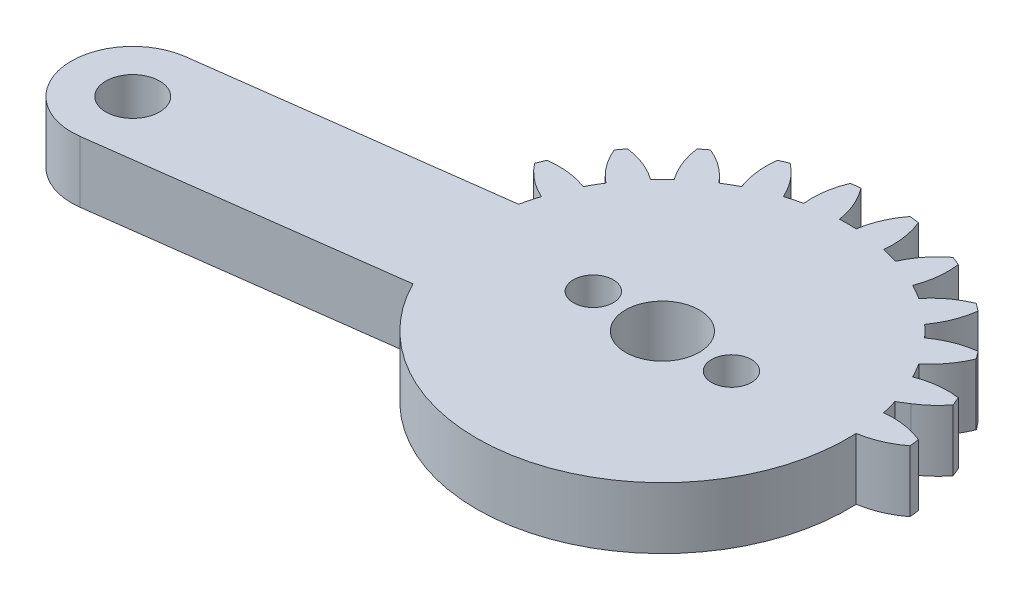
from build123d import *
from build123d.topology import SkipClean

# Parameters (mm, degrees)
SKETCH1_R           = 1.5
BOSS_EXTRUDE1_DEPTH = 4
SKETCH3_R           = 1.75
BOSS_EXTRUDE2_DEPTH = 4
CUT_EXTRUDE1_START  = -4
CUT_EXTRUDE1_DEPTH  = 4
CUT_EXTRUDE2_REACH  = 49.073
SKETCH5_R           = 1.3
SKETCH5_R_2         = 2.4


with BuildPart() as part:
    # Sketch1 → Boss-Extrude1 (new body)
    with BuildSketch(Plane(origin=(0, 0, 0), x_dir=(1, 0, 0), z_dir=(0, 1, 0))):
        with BuildLine():
            Line((20.643657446, 4), (2.081641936, 4))
            ThreePointArc((2.081641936, 4), (2.861028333, 4.588201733), (3.521749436, 5.30713988))
            ThreePointArc((3.521749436, 5.30713988), (3.405395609, 5.596745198), (3.282888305, 5.883801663))
            ThreePointArc((3.282888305, 5.883801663), (1.93527598, 5.894040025), (0.627094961, 5.57027124))
            ThreePointArc((0.627094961, 5.57027124), (0.366286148, 6.046375), (0.084372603, 6.510293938))
            ThreePointArc((0.084372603, 6.510293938), (1.018855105, 7.48132754), (1.683794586, 8.65351323))
            ThreePointArc((1.683794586, 8.65351323), (1.496450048, 8.903135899), (1.303821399, 9.148703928))
            ThreePointArc((1.303821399, 9.148703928), (-0.000522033, 8.809805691), (-1.180330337, 8.158486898))
            ThreePointArc((-1.180330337, 8.158486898), (-1.555477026, 8.550865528), (-1.947855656, 8.926012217))
            ThreePointArc((-1.947855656, 8.926012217), (-1.296536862, 10.105820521), (-0.957638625, 11.410163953))
            ThreePointArc((-0.957638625, 11.410163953), (-1.203206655, 11.602792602), (-1.452829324, 11.79013714))
            ThreePointArc((-1.452829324, 11.79013714), (-2.625015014, 11.125197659), (-3.596048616, 10.190715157))
            ThreePointArc((-3.596048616, 10.190715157), (-4.059967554, 10.472628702), (-4.536071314, 10.733437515))
            ThreePointArc((-4.536071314, 10.733437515), (-4.212302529, 12.041618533), (-4.222540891, 13.389230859))
            ThreePointArc((-4.222540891, 13.389230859), (-4.509597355, 13.511738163), (-4.799202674, 13.62809199))
            ThreePointArc((-4.799202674, 13.62809199), (-5.759348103, 12.682425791), (-6.455432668, 11.528463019))
            ThreePointArc((-6.455432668, 11.528463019), (-6.976508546, 11.680699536), (-7.503891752, 11.809396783))
            ThreePointArc((-7.503891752, 11.809396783), (-7.529737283, 13.156800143), (-7.888414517, 14.455843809))
            ThreePointArc((-7.888414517, 14.455843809), (-8.197396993, 14.499881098), (-8.507248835, 14.537314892))
            ThreePointArc((-8.507248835, 14.537314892), (-9.18992168, 13.375367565), (-9.563620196, 12.080565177))
            ThreePointArc((-9.563620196, 12.080565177), (-10.106342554, 12.09275), (-10.649064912, 12.080565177))
            ThreePointArc((-10.649064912, 12.080565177), (-11.022763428, 13.375367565), (-11.705436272, 14.537314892))
            ThreePointArc((-11.705436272, 14.537314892), (-12.015288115, 14.499881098), (-12.324270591, 14.455843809))
            ThreePointArc((-12.324270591, 14.455843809), (-12.682947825, 13.156800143), (-12.708793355, 11.809396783))
            ThreePointArc((-12.708793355, 11.809396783), (-13.236176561, 11.680699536), (-13.757252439, 11.528463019))
            ThreePointArc((-13.757252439, 11.528463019), (-14.453337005, 12.682425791), (-15.413482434, 13.62809199))
            ThreePointArc((-15.413482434, 13.62809199), (-15.703087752, 13.511738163), (-15.990144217, 13.389230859))
            ThreePointArc((-15.990144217, 13.389230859), (-16.000382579, 12.041618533), (-15.676613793, 10.733437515))
            ThreePointArc((-15.676613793, 10.733437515), (-16.152717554, 10.472628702), (-16.616636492, 10.190715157))
            ThreePointArc((-16.616636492, 10.190715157), (-17.587670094, 11.125197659), (-18.759855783, 11.79013714))
            ThreePointArc((-18.759855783, 11.79013714), (-19.009478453, 11.602792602), (-19.255046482, 11.410163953))
            ThreePointArc((-19.255046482, 11.410163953), (-18.916148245, 10.105820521), (-18.264829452, 8.926012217))
            ThreePointArc((-18.264829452, 8.926012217), (-18.657208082, 8.550865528), (-19.032354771, 8.158486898))
            ThreePointArc((-19.032354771, 8.158486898), (-20.212163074, 8.809805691), (-21.516506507, 9.148703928))
            ThreePointArc((-21.516506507, 9.148703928), (-21.709135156, 8.903135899), (-21.896479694, 8.65351323))
            ThreePointArc((-21.896479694, 8.65351323), (-21.231540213, 7.48132754), (-20.297057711, 6.510293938))
            ThreePointArc((-20.297057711, 6.510293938), (-20.578971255, 6.046375), (-20.839780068, 5.57027124))
            ThreePointArc((-20.839780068, 5.57027124), (-22.147961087, 5.894040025), (-23.495573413, 5.883801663))
            ThreePointArc((-23.495573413, 5.883801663), (-23.618080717, 5.596745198), (-23.734434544, 5.30713988))
            ThreePointArc((-23.734434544, 5.30713988), (-22.788768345, 4.346994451), (-21.634805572, 3.650909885))
            ThreePointArc((-21.634805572, 3.650909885), (-21.78704209, 3.129834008), (-21.915739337, 2.602450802))
            ThreePointArc((-21.915739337, 2.602450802), (-23.263142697, 2.576605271), (-24.562186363, 2.217928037))
            ThreePointArc((-24.562186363, 2.217928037), (-24.606223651, 1.908945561), (-24.643657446, 1.599093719))
            ThreePointArc((-24.643657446, 1.599093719), (-23.481710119, 0.916420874), (-22.186907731, 0.542722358))
            ThreePointArc((-22.186907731, 0.542722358), (-22.199092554, 0), (-22.186907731, -0.542722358))
            ThreePointArc((-22.186907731, -0.542722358), (-23.481710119, -0.916420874), (-24.643657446, -1.599093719))
            ThreePointArc((-24.643657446, -1.599093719), (-24.606223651, -1.908945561), (-24.562186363, -2.217928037))
            ThreePointArc((-24.562186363, -2.217928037), (-23.263142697, -2.576605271), (-21.915739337, -2.602450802))
            ThreePointArc((-21.915739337, -2.602450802), (-21.78704209, -3.129834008), (-21.634805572, -3.650909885))
            ThreePointArc((-21.634805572, -3.650909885), (-22.788768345, -4.346994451), (-23.734434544, -5.30713988))
            ThreePointArc((-23.734434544, -5.30713988), (-23.618080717, -5.596745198), (-23.495573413, -5.883801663))
            ThreePointArc((-23.495573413, -5.883801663), (-22.147961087, -5.894040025), (-20.839780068, -5.57027124))
            ThreePointArc((-20.839780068, -5.57027124), (-20.578971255, -6.046375), (-20.297057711, -6.510293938))
            ThreePointArc((-20.297057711, -6.510293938), (-21.231540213, -7.48132754), (-21.896479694, -8.65351323))
            ThreePointArc((-21.896479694, -8.65351323), (-21.709135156, -8.903135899), (-21.516506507, -9.148703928))
            ThreePointArc((-21.516506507, -9.148703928), (-20.212163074, -8.809805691), (-19.032354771, -8.158486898))
            ThreePointArc((-19.032354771, -8.158486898), (-18.657208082, -8.550865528), (-18.264829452, -8.926012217))
            ThreePointArc((-18.264829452, -8.926012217), (-18.916148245, -10.105820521), (-19.255046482, -11.410163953))
            ThreePointArc((-19.255046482, -11.410163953), (-19.009478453, -11.602792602), (-18.759855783, -11.79013714))
            ThreePointArc((-18.759855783, -11.79013714), (-17.587670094, -11.125197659), (-16.616636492, -10.190715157))
            ThreePointArc((-16.616636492, -10.190715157), (-16.152717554, -10.472628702), (-15.676613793, -10.733437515))
            ThreePointArc((-15.676613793, -10.733437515), (-16.000382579, -12.041618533), (-15.990144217, -13.389230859))
            ThreePointArc((-15.990144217, -13.389230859), (-15.703087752, -13.511738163), (-15.413482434, -13.62809199))
            ThreePointArc((-15.413482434, -13.62809199), (-14.453337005, -12.682425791), (-13.757252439, -11.528463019))
            ThreePointArc((-13.757252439, -11.528463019), (-13.236176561, -11.680699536), (-12.708793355, -11.809396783))
            ThreePointArc((-12.708793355, -11.809396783), (-12.682947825, -13.156800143), (-12.324270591, -14.455843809))
            ThreePointArc((-12.324270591, -14.455843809), (-12.015288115, -14.499881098), (-11.705436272, -14.537314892))
            ThreePointArc((-11.705436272, -14.537314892), (-11.022763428, -13.375367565), (-10.649064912, -12.080565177))
            ThreePointArc((-10.649064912, -12.080565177), (-10.106342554, -12.09275), (-9.563620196, -12.080565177))
            ThreePointArc((-9.563620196, -12.080565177), (-9.18992168, -13.375367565), (-8.507248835, -14.537314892))
            ThreePointArc((-8.507248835, -14.537314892), (-8.197396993, -14.499881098), (-7.888414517, -14.455843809))
            ThreePointArc((-7.888414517, -14.455843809), (-7.529737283, -13.156800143), (-7.503891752, -11.809396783))
            ThreePointArc((-7.503891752, -11.809396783), (-6.976508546, -11.680699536), (-6.455432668, -11.528463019))
            ThreePointArc((-6.455432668, -11.528463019), (-5.759348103, -12.682425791), (-4.799202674, -13.62809199))
            ThreePointArc((-4.799202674, -13.62809199), (-4.509597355, -13.511738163), (-4.222540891, -13.389230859))
            ThreePointArc((-4.222540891, -13.389230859), (-4.212302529, -12.041618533), (-4.536071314, -10.733437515))
            ThreePointArc((-4.536071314, -10.733437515), (-4.059967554, -10.472628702), (-3.596048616, -10.190715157))
            ThreePointArc((-3.596048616, -10.190715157), (-2.625015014, -11.125197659), (-1.452829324, -11.79013714))
            ThreePointArc((-1.452829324, -11.79013714), (-1.203206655, -11.602792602), (-0.957638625, -11.410163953))
            ThreePointArc((-0.957638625, -11.410163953), (-1.296536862, -10.105820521), (-1.947855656, -8.926012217))
            ThreePointArc((-1.947855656, -8.926012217), (-1.555477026, -8.550865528), (-1.180330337, -8.158486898))
            ThreePointArc((-1.180330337, -8.158486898), (-0.000522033, -8.809805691), (1.303821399, -9.148703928))
            ThreePointArc((1.303821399, -9.148703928), (1.496450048, -8.903135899), (1.683794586, -8.65351323))
            ThreePointArc((1.683794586, -8.65351323), (1.018855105, -7.48132754), (0.084372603, -6.510293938))
            ThreePointArc((0.084372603, -6.510293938), (0.366286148, -6.046375), (0.627094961, -5.57027124))
            ThreePointArc((0.627094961, -5.57027124), (1.93527598, -5.894040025), (3.282888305, -5.883801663))
            ThreePointArc((3.282888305, -5.883801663), (3.405395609, -5.596745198), (3.521749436, -5.30713988))
            ThreePointArc((3.521749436, -5.30713988), (2.861028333, -4.588201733), (2.081641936, -4))
            Line((2.081641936, -4), (20.643657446, -4))
            ThreePointArc((20.643657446, -4), (24.643657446, 0), (20.643657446, 4))
        make_face()
        with Locations(Location((-10.106342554, 0, 0), (0, 0, 270))):
            Circle(SKETCH1_R, mode=Mode.SUBTRACT)
        with Locations(Location((20.643657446, 0, 0), (0, 0, 270))):
            Circle(SKETCH1_R, mode=Mode.SUBTRACT)
    extrude(amount=BOSS_EXTRUDE1_DEPTH)

    # Sketch3 → Boss-Extrude2 (add)
    with BuildSketch(Plane(origin=(0, 4, 0), x_dir=(1, 0, 0), z_dir=(0, 1, 0))):
        with BuildLine():
            ThreePointArc((-9.584237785, -3.965779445), (-14.072121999, -0.522104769), (-10.628447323, 3.965779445))
            Line((-10.628447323, 3.965779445), (-41.11537681, -0.047900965))
            ThreePointArc((-41.11537681, -0.047900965), (-44.559051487, -4.53578518), (-40.071167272, -7.979459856))
            Line((-40.071167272, -7.979459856), (-9.584237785, -3.965779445))
        make_face()
        with Locations(Location((-40.593272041, -4.013680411, 0), (0, 0, 270))):
            Circle(SKETCH3_R, mode=Mode.SUBTRACT)
    extrude(amount=-BOSS_EXTRUDE2_DEPTH)

    # Sketch4 → Cut-Extrude1 (cut)
    with SkipClean():  # the faces are left unmerged after this step: merging them gives an invalid solid
        with BuildSketch(Plane(origin=(0, 4, 0), x_dir=(1, 0, 0), z_dir=(0, 1, 0)).offset(CUT_EXTRUDE1_START)):
            with BuildLine():
                ThreePointArc((20.643657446, -4), (24.643657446, 0), (20.643657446, 4))
                Line((20.643657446, 4), (2.081641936, 4))
                Line((2.081641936, 4), (1.43808022, 3.600125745))
                ThreePointArc((1.43808022, 3.600125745), (1.581217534, 3.104116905), (1.70305423, 2.602450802))
                ThreePointArc((1.70305423, 2.602450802), (3.050457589, 2.576605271), (4.349501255, 2.217928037))
                ThreePointArc((4.349501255, 2.217928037), (4.393538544, 1.908945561), (4.430972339, 1.599093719))
                ThreePointArc((4.430972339, 1.599093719), (3.269025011, 0.916420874), (1.974222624, 0.542722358))
                ThreePointArc((1.974222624, 0.542722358), (1.70305423, -2.602450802), (0.627094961, -5.57027124))
                ThreePointArc((0.627094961, -5.57027124), (1.93527598, -5.894040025), (3.282888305, -5.883801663))
                ThreePointArc((3.282888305, -5.883801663), (3.405395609, -5.596745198), (3.521749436, -5.30713988))
                ThreePointArc((3.521749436, -5.30713988), (2.861028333, -4.588201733), (2.081641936, -4))
                Line((2.081641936, -4), (20.643657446, -4))
            make_face()
            with BuildLine():
                ThreePointArc((1.683794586, -8.65351323), (1.018855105, -7.48132754), (0.084372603, -6.510293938))
                ThreePointArc((0.084372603, -6.510293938), (-0.512518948, -7.361599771), (-1.180330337, -8.158486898))
                ThreePointArc((-1.180330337, -8.158486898), (-0.000522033, -8.809805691), (1.303821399, -9.148703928))
                ThreePointArc((1.303821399, -9.148703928), (1.496450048, -8.903135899), (1.683794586, -8.65351323))
            make_face()
            with BuildLine():
                ThreePointArc((-0.957638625, -11.410163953), (-1.296536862, -10.105820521), (-1.947855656, -8.926012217))
                ThreePointArc((-1.947855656, -8.926012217), (-2.744742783, -9.593823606), (-3.596048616, -10.190715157))
                ThreePointArc((-3.596048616, -10.190715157), (-2.625015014, -11.125197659), (-1.452829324, -11.79013714))
                ThreePointArc((-1.452829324, -11.79013714), (-1.203206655, -11.602792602), (-0.957638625, -11.410163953))
            make_face()
            with BuildLine():
                ThreePointArc((-4.222540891, -13.389230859), (-4.212302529, -12.041618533), (-4.536071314, -10.733437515))
                ThreePointArc((-4.536071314, -10.733437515), (-5.478647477, -11.172244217), (-6.455432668, -11.528463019))
                ThreePointArc((-6.455432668, -11.528463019), (-5.759348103, -12.682425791), (-4.799202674, -13.62809199))
                ThreePointArc((-4.799202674, -13.62809199), (-4.509597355, -13.511738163), (-4.222540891, -13.389230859))
            make_face()
            with BuildLine():
                ThreePointArc((-7.888414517, -14.455843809), (-7.529737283, -13.156800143), (-7.503891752, -11.809396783))
                ThreePointArc((-7.503891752, -11.809396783), (-8.527921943, -11.989294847), (-9.563620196, -12.080565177))
                ThreePointArc((-9.563620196, -12.080565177), (-9.18992168, -13.375367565), (-8.507248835, -14.537314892))
                ThreePointArc((-8.507248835, -14.537314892), (-8.197396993, -14.499881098), (-7.888414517, -14.455843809))
            make_face()
            with BuildLine():
                ThreePointArc((-11.705436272, -14.537314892), (-11.022763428, -13.375367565), (-10.649064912, -12.080565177))
                ThreePointArc((-10.649064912, -12.080565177), (-11.684763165, -11.989294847), (-12.708793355, -11.809396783))
                ThreePointArc((-12.708793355, -11.809396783), (-12.682947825, -13.156800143), (-12.324270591, -14.455843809))
                ThreePointArc((-12.324270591, -14.455843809), (-12.015288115, -14.499881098), (-11.705436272, -14.537314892))
            make_face()
            with BuildLine():
                ThreePointArc((-15.413482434, -13.62809199), (-14.453337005, -12.682425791), (-13.757252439, -11.528463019))
                ThreePointArc((-13.757252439, -11.528463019), (-14.734037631, -11.172244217), (-15.676613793, -10.733437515))
                ThreePointArc((-15.676613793, -10.733437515), (-16.000382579, -12.041618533), (-15.990144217, -13.389230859))
                ThreePointArc((-15.990144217, -13.389230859), (-15.703087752, -13.511738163), (-15.413482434, -13.62809199))
            make_face()
            with BuildLine():
                ThreePointArc((-18.759855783, -11.79013714), (-17.587670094, -11.125197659), (-16.616636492, -10.190715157))
                ThreePointArc((-16.616636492, -10.190715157), (-17.467942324, -9.593823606), (-18.264829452, -8.926012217))
                ThreePointArc((-18.264829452, -8.926012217), (-18.916148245, -10.105820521), (-19.255046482, -11.410163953))
                ThreePointArc((-19.255046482, -11.410163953), (-19.009478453, -11.602792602), (-18.759855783, -11.79013714))
            make_face()
            with BuildLine():
                ThreePointArc((-21.516506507, -9.148703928), (-20.212163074, -8.809805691), (-19.032354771, -8.158486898))
                ThreePointArc((-19.032354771, -8.158486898), (-19.70016616, -7.361599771), (-20.297057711, -6.510293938))
                ThreePointArc((-20.297057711, -6.510293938), (-21.231540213, -7.48132754), (-21.896479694, -8.65351323))
                ThreePointArc((-21.896479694, -8.65351323), (-21.709135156, -8.903135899), (-21.516506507, -9.148703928))
            make_face()
            with BuildLine():
                ThreePointArc((-21.942853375, 2.47620963), (-21.92946485, 2.539366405), (-21.915739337, 2.602450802))
                ThreePointArc((-21.915739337, 2.602450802), (-23.263142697, 2.576605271), (-24.562186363, 2.217928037))
                ThreePointArc((-24.562186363, 2.217928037), (-24.56889027, 2.173784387), (-24.575459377, 2.129620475))
                Line((-24.575459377, 2.129620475), (-21.942853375, 2.47620963))
            make_face()
            with BuildLine():
                ThreePointArc((-23.495573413, -5.883801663), (-22.147961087, -5.894040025), (-20.839780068, -5.57027124))
                ThreePointArc((-20.839780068, -5.57027124), (-20.869365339, -5.512888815), (-20.898643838, -5.455349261))
                Line((-20.898643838, -5.455349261), (-23.531249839, -5.801938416))
                ThreePointArc((-23.531249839, -5.801938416), (-23.513474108, -5.842897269), (-23.495573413, -5.883801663))
            make_face()
        extrude(amount=CUT_EXTRUDE1_DEPTH, mode=Mode.SUBTRACT)

    # Sketch5 → Cut-Extrude2 (cut, up to next)
    with BuildSketch(Plane(origin=(0, 4, 0), x_dir=(1, 0, 0), z_dir=(0, 1, 0)), mode=Mode.PRIVATE) as cut_extrude2_sk1:
        with Locations(Location((-14.606342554, 0, 0), (0, 0, 270))):
            Circle(SKETCH5_R)
    cut_extrude2_tool1 = extrude(cut_extrude2_sk1.sketch, amount=-CUT_EXTRUDE2_REACH, mode=Mode.PRIVATE) & part.part
    # Sketch5 → Cut-Extrude2 (cut, up to next)
    with BuildSketch(Plane(origin=(0, 4, 0), x_dir=(1, 0, 0), z_dir=(0, 1, 0)), mode=Mode.PRIVATE) as cut_extrude2_sk2:
        with Locations(Location((-5.606342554, 0, 0), (0, 0, 270))):
            Circle(SKETCH5_R)
    cut_extrude2_tool2 = extrude(cut_extrude2_sk2.sketch, amount=-CUT_EXTRUDE2_REACH, mode=Mode.PRIVATE) & part.part
    # Sketch5 → Cut-Extrude2 (cut, up to next)
    with BuildSketch(Plane(origin=(0, 4, 0), x_dir=(1, 0, 0), z_dir=(0, 1, 0)), mode=Mode.PRIVATE) as cut_extrude2_sk3:
        with Locations(Location((-10.106342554, 0, 0), (0, 0, 270))):
            Circle(SKETCH5_R_2)
    cut_extrude2_tool3 = extrude(cut_extrude2_sk3.sketch, amount=-CUT_EXTRUDE2_REACH, mode=Mode.PRIVATE) & part.part
    add(cut_extrude2_tool1.solids().sort_by_distance((-14.606343, 4, 0))[0], mode=Mode.SUBTRACT)
    add(cut_extrude2_tool2.solids().sort_by_distance((-5.606343, 4, 0))[0], mode=Mode.SUBTRACT)
    add(cut_extrude2_tool3.solids().sort_by_distance((-10.106343, 4, 0))[0], mode=Mode.SUBTRACT)


solid = part.part
